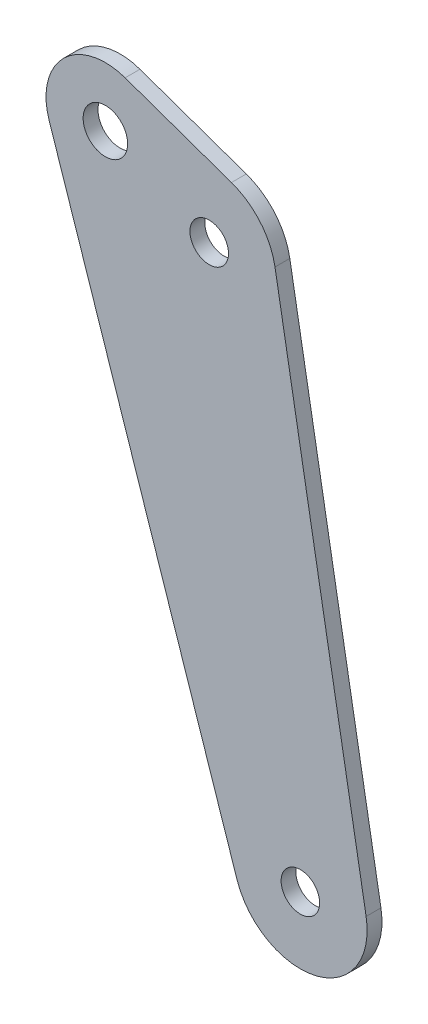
from build123d import *

# Parameters (mm, degrees)
SK_PLACA_JAULA_EXTERIOR_R   = 3
SK_PLACA_JAULA_EXTERIOR_R_2 = 2.6
PLACA_JAULA_EXTERIOR_DEPTH  = 2


with BuildPart() as part:
    # Sk_Placa_jaula_exterior → Placa_jaula_exterior (new body)
    with BuildSketch(Plane.XY.offset(4.2)):
        with BuildLine():
            Line((-43.589272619, -64.530403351), (-18.252323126, -140.521852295))
            ThreePointArc((-18.252323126, -140.521852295), (-7.503629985, -146.399398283), (-0.851121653, -136.112314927))
            Line((-0.851121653, -136.112314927), (-13.136730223, -66.437166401))
            ThreePointArc((-13.136730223, -66.437166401), (-15.134246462, -62.180942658), (-19.005478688, -59.512783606))
            Line((-19.005478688, -59.512783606), (-33.338203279, -54.45580765))
            ThreePointArc((-33.338203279, -54.45580765), (-41.60752836, -56.294246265), (-43.589272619, -64.530403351))
        make_face()
        with Locations((-36, -62)):
            Circle(SK_PLACA_JAULA_EXTERIOR_R, mode=Mode.SUBTRACT)
        with Locations((-22, -68)):
            Circle(SK_PLACA_JAULA_EXTERIOR_R_2, mode=Mode.SUBTRACT)
        with Locations((-9.71439143, -137.675148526)):
            Circle(SK_PLACA_JAULA_EXTERIOR_R_2, mode=Mode.SUBTRACT)
    extrude(amount=PLACA_JAULA_EXTERIOR_DEPTH)


solid = part.part
